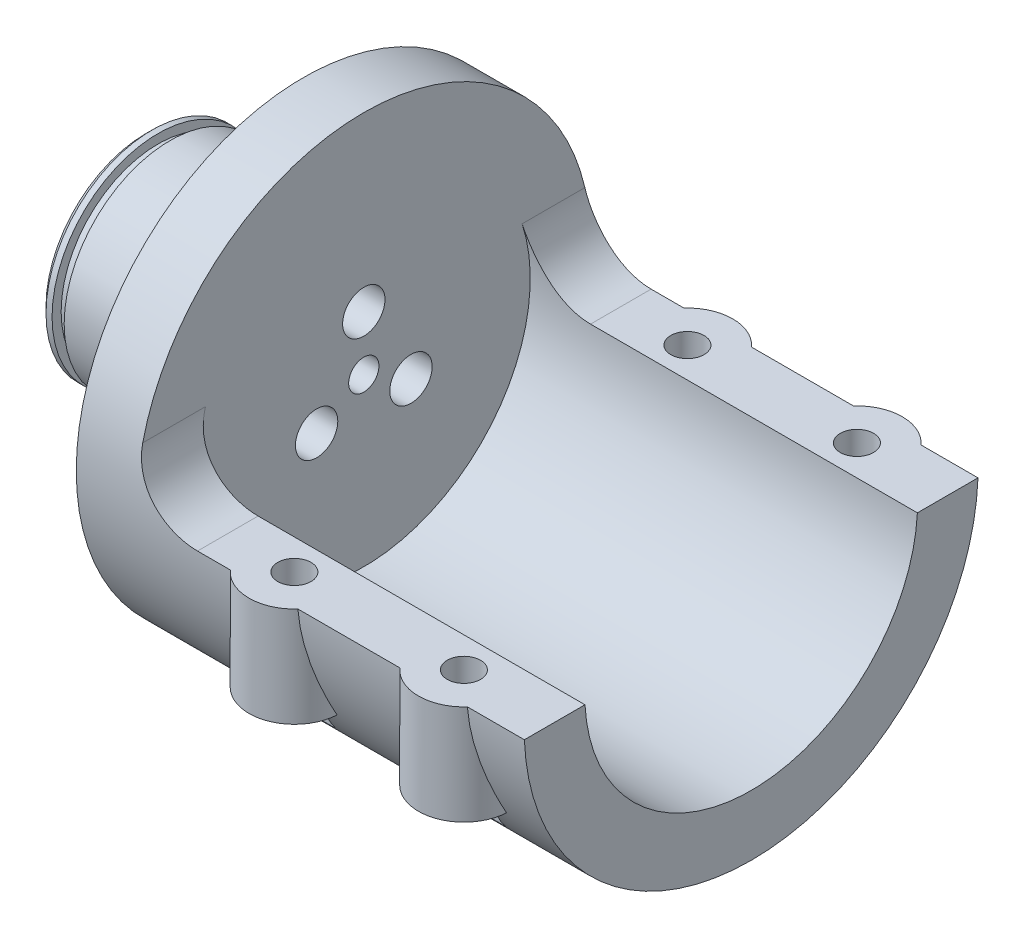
from build123d import *

# Parameters (mm, degrees)
ENL_V_MAT_EXTRU_1_DEPTH           = 114.192314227
ENL_V_MAT_EXTRU_1_DEPTH_BACK      = 114.192314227
EXTRUSION1_DEPTH                  = 16.5
ENL_V_MAT_EXTRU_2_DEPTH           = 6
ENL_V_MAT_EXTRU_2_OTHER_WAY_DEPTH = 122.150374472
ENL_V_MAT_EXTRU_2_OTHER_WAY_TAPER = -2
ESQUISSE5_R                       = 2.75
ENL_V_MAT_EXTRU_3_DEPTH           = 115.534550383
ESQUISSE6_R                       = 3.5
ENL_V_MAT_EXTRU_4_DEPTH           = 85.258015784
CHANFREIN1_SIZE                   = 1


with BuildPart() as part:
    # Esquisse1 → R_volution1 (revolve)
    with BuildSketch(Plane.XY, mode=Mode.PRIVATE) as r_volution1_sk:
        with BuildLine():
            Line((0, 16.5), (0, 2.5))
            Line((0, 2.5), (36, 2.5))
            Line((36, 2.5), (36, 27.5))
            Line((36, 27.5), (100, 27.5))
            Line((100, 27.5), (100, 37.5))
            Line((100, 37.5), (26, 37.5))
            Line((26, 37.5), (26, 31.970814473))
            ThreePointArc((26, 31.970814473), (23.656854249, 26.313960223), (18, 23.970814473))
            Line((18, 23.970814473), (18, 17.5))
            Line((18, 17.5), (4, 17.5))
            Line((4, 17.5), (4, 16))
            Line((4, 16), (2, 16))
            Line((2, 16), (2, 17.5))
            Line((2, 17.5), (1, 17.5))
            Line((1, 17.5), (0, 16.5))
        make_face()
    revolve(r_volution1_sk.sketch.rotate(Axis((0, 0, 0), (1, 0, 0)), 90), axis=Axis((0, 0, 0), (1, 0, 0)))

    # Esquisse2 → Enl_v. mat.-Extru.1 (cut, two sides: drawn at the far end of the back side and taken through both)
    with BuildSketch(Plane.XY.offset(-ENL_V_MAT_EXTRU_1_DEPTH_BACK)):
        with BuildLine():
            Line((36, 40.868359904), (36, 8.5))
            ThreePointArc((36, 8.5), (38.928932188, 1.428932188), (46, -1.5))
            Line((46, -1.5), (100, -1.5))
            Line((100, -1.5), (100, 40.868359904))
            Line((100, 40.868359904), (36, 40.868359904))
        make_face()
    extrude(amount=ENL_V_MAT_EXTRU_1_DEPTH + ENL_V_MAT_EXTRU_1_DEPTH_BACK, mode=Mode.SUBTRACT)

    # Esquisse3 → Extrusion1 (add)
    with BuildSketch(Plane(origin=(0, -1.5, 0), x_dir=(-1, 0, 0), z_dir=(0, 1, 0))):
        with BuildLine():
            Line((-91.700381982, 29.094823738), (-78.299618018, 29.094823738))
            ThreePointArc((-78.299618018, 29.094823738), (-85, 39.964524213), (-91.700381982, 29.094823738))
        make_face()
        with BuildLine():
            Line((-63.700381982, 29.094823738), (-50.299618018, 29.094823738))
            ThreePointArc((-50.299618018, 29.094823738), (-57, 39.964524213), (-63.700381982, 29.094823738))
        make_face()
        with BuildLine():
            Line((-63.700381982, -29.094823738), (-50.299618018, -29.094823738))
            ThreePointArc((-50.299618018, -29.094823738), (-57, -39.964524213), (-63.700381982, -29.094823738))
        make_face()
        with BuildLine():
            Line((-91.700381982, -29.094823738), (-78.299618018, -29.094823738))
            ThreePointArc((-78.299618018, -29.094823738), (-85, -39.964524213), (-91.700381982, -29.094823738))
        make_face()
    extrude(amount=-EXTRUSION1_DEPTH)

    # Esquisse4 → Enl_v. mat.-Extru.2 (cut)
    with BuildSketch(Plane.XZ.offset(18)):
        Polygon((82.632863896, -36.564524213), (87.367136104, -36.564524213), (89.734272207, -32.464524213), (87.367136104, -28.364524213), (82.632863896, -28.364524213), (80.265727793, -32.464524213), align=None)
        Polygon((54.632863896, -36.564524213), (59.367136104, -36.564524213), (61.734272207, -32.464524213), (59.367136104, -28.364524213), (54.632863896, -28.364524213), (52.265727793, -32.464524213), align=None)
        Polygon((52.265727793, 32.464524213), (54.632863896, 28.364524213), (59.367136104, 28.364524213), (61.734272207, 32.464524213), (59.367136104, 36.564524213), (54.632863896, 36.564524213), align=None)
        Polygon((80.265727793, 32.464524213), (82.632863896, 28.364524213), (87.367136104, 28.364524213), (89.734272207, 32.464524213), (87.367136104, 36.564524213), (82.632863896, 36.564524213), align=None)
    extrude(amount=-ENL_V_MAT_EXTRU_2_DEPTH, mode=Mode.SUBTRACT)

    # Esquisse4 → Enl_v. mat.-Extru.2 other way (cut)
    with BuildSketch(Plane.XZ.offset(18)):
        Polygon((82.632863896, -36.564524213), (87.367136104, -36.564524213), (89.734272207, -32.464524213), (87.367136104, -28.364524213), (82.632863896, -28.364524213), (80.265727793, -32.464524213), align=None)
        Polygon((54.632863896, -36.564524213), (59.367136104, -36.564524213), (61.734272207, -32.464524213), (59.367136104, -28.364524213), (54.632863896, -28.364524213), (52.265727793, -32.464524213), align=None)
        Polygon((52.265727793, 32.464524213), (54.632863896, 28.364524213), (59.367136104, 28.364524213), (61.734272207, 32.464524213), (59.367136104, 36.564524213), (54.632863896, 36.564524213), align=None)
        Polygon((80.265727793, 32.464524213), (82.632863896, 28.364524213), (87.367136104, 28.364524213), (89.734272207, 32.464524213), (87.367136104, 36.564524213), (82.632863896, 36.564524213), align=None)
    extrude(amount=ENL_V_MAT_EXTRU_2_OTHER_WAY_DEPTH, taper=ENL_V_MAT_EXTRU_2_OTHER_WAY_TAPER, mode=Mode.SUBTRACT)

    # Esquisse5 → Enl_v. mat.-Extru.3 (cut, through all)
    with BuildSketch(Plane(origin=(0, -1.5, 0), x_dir=(-1, 0, 0), z_dir=(0, 1, 0))):
        with Locations(Location((-85, -32.464524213, 0), (0, 0, 90))):
            Circle(ESQUISSE5_R)
        with Locations(Location((-57, -32.464524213, 0), (0, 0, 90))):
            Circle(ESQUISSE5_R)
        with Locations(Location((-57, 32.464524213, 0), (0, 0, 270))):
            Circle(ESQUISSE5_R)
        with Locations(Location((-85, 32.464524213, 0), (0, 0, 270))):
            Circle(ESQUISSE5_R)
    extrude(amount=-ENL_V_MAT_EXTRU_3_DEPTH, mode=Mode.SUBTRACT)

    # Esquisse6 → Enl_v. mat.-Extru.4 (cut, through all)
    with BuildSketch(Plane(origin=(36, 0, 0), x_dir=(0, 0, -1), z_dir=(1, 0, 0))):
        with Locations((0, 9)):
            Circle(ESQUISSE6_R)
        with Locations((7.794228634, -4.5)):
            Circle(ESQUISSE6_R)
        with Locations((-7.794228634, -4.5)):
            Circle(ESQUISSE6_R)
    extrude(amount=-ENL_V_MAT_EXTRU_4_DEPTH, mode=Mode.SUBTRACT)

    # Chanfrein1
    chanfrein1_edges = [part.edges().sort_by_distance(p)[0] for p in [
        (0, 9, 3.5),
        (0, -4.5, -4.294228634),
        (0, -4.5, 11.294228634),
    ]]
    chamfer(chanfrein1_edges, length=CHANFREIN1_SIZE)


solid = part.part
